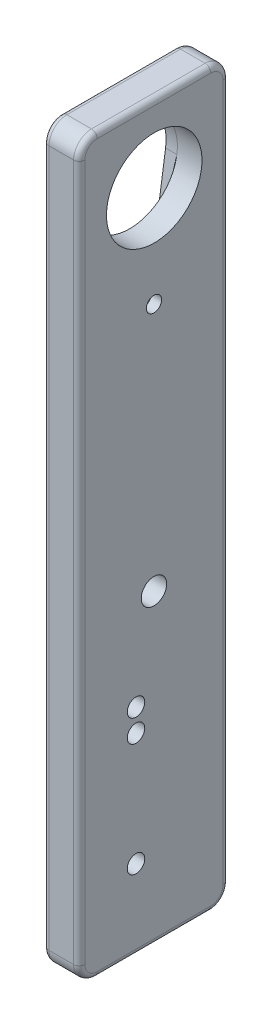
ISO-10303-21;
HEADER;
FILE_DESCRIPTION(('STEP AP214'),'2;1');
FILE_NAME('part.step','',(''),(''),'','','');
FILE_SCHEMA(('AUTOMOTIVE_DESIGN { 1 0 10303 214 1 1 1 1 }'));
ENDSEC;
DATA;
#1=APPLICATION_CONTEXT('core data for automotive mechanical design processes');
#2=APPLICATION_PROTOCOL_DEFINITION('international standard','automotive_design',2000,#1);
#3=PRODUCT_CONTEXT('',#1,'mechanical');
#4=PRODUCT('Part','Part','',(#3));
#5=PRODUCT_RELATED_PRODUCT_CATEGORY('part','',(#4));
#6=PRODUCT_DEFINITION_FORMATION('','',#4);
#7=PRODUCT_DEFINITION_CONTEXT('part definition',#1,'design');
#8=PRODUCT_DEFINITION('design','',#6,#7);
#9=PRODUCT_DEFINITION_SHAPE('','',#8);
#10=(LENGTH_UNIT() NAMED_UNIT(*) SI_UNIT(.MILLI.,.METRE.));
#11=(NAMED_UNIT(*) PLANE_ANGLE_UNIT() SI_UNIT($,.RADIAN.));
#12=(NAMED_UNIT(*) SI_UNIT($,.STERADIAN.) SOLID_ANGLE_UNIT());
#13=UNCERTAINTY_MEASURE_WITH_UNIT(LENGTH_MEASURE(1.E-05),#10,'distance_accuracy_value','');
#14=(GEOMETRIC_REPRESENTATION_CONTEXT(3) GLOBAL_UNCERTAINTY_ASSIGNED_CONTEXT((#13)) GLOBAL_UNIT_ASSIGNED_CONTEXT((#10,
#11,#12)) REPRESENTATION_CONTEXT('',''));
#15=CARTESIAN_POINT('',(0.,0.,0.));
#16=DIRECTION('',(0.,0.,1.));
#17=DIRECTION('',(1.,0.,0.));
#18=AXIS2_PLACEMENT_3D('',#15,#16,#17);
#19=CARTESIAN_POINT('',(-28.2777584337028,30.3156864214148,1.62195543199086));
#20=DIRECTION('',(-1.,0.,0.));
#21=DIRECTION('',(0.,0.,1.));
#22=AXIS2_PLACEMENT_3D('',#19,#20,#21);
#23=CYLINDRICAL_SURFACE('',#22,1.35);
#24=CARTESIAN_POINT('',(-39.6009605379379,30.3156864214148,1.62195543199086));
#25=DIRECTION('',(1.,0.,0.));
#26=DIRECTION('',(0.,0.,-1.));
#27=AXIS2_PLACEMENT_3D('',#24,#25,#26);
#28=CIRCLE('',#27,1.35);
#29=CARTESIAN_POINT('',(-39.6009605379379,30.3156864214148,0.271955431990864));
#30=VERTEX_POINT('',#29);
#31=EDGE_CURVE('E364',#30,#30,#28,.F.);
#32=ORIENTED_EDGE('',*,*,#31,.F.);
#33=EDGE_LOOP('',(#32));
#34=FACE_BOUND('',#33,.T.);
#35=CARTESIAN_POINT('',(-41.4109605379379,30.3156864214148,1.62195543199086));
#36=DIRECTION('',(-1.,0.,0.));
#37=DIRECTION('',(0.,0.,1.));
#38=AXIS2_PLACEMENT_3D('',#35,#36,#37);
#39=CIRCLE('',#38,1.35000000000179);
#40=CARTESIAN_POINT('',(-41.4109605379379,30.3156864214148,2.97195543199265));
#41=VERTEX_POINT('',#40);
#42=EDGE_CURVE('E637',#41,#41,#39,.T.);
#43=ORIENTED_EDGE('',*,*,#42,.T.);
#44=EDGE_LOOP('',(#43));
#45=FACE_BOUND('',#44,.T.);
#46=ADVANCED_FACE('F39',(#34,#45),#23,.F.);
#47=CARTESIAN_POINT('',(-39.6009605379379,-67.9224024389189,4.79852832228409));
#48=DIRECTION('',(0.,-1.,0.));
#49=DIRECTION('',(0.,0.,-1.));
#50=AXIS2_PLACEMENT_3D('',#47,#48,#49);
#51=PLANE('',#50);
#52=DIRECTION('',(-1.,0.,0.));
#53=VECTOR('',#52,1.);
#54=CARTESIAN_POINT('',(-39.6009605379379,-67.9224024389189,-8.42647167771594));
#55=LINE('',#54,#53);
#56=CARTESIAN_POINT('',(-44.9509605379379,-67.9224024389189,-8.42647167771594));
#57=VERTEX_POINT('',#56);
#58=CARTESIAN_POINT('',(-40.6009605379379,-67.9224024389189,-8.42647167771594));
#59=VERTEX_POINT('',#58);
#60=EDGE_CURVE('E268',#57,#59,#55,.F.);
#61=ORIENTED_EDGE('',*,*,#60,.T.);
#62=DIRECTION('',(0.,0.,1.));
#63=VECTOR('',#62,1.);
#64=CARTESIAN_POINT('',(-40.6009605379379,-67.9224024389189,4.79852832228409));
#65=LINE('',#64,#63);
#66=CARTESIAN_POINT('',(-40.6009605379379,-67.9224024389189,11.6735283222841));
#67=VERTEX_POINT('',#66);
#68=EDGE_CURVE('E314',#59,#67,#65,.T.);
#69=ORIENTED_EDGE('',*,*,#68,.T.);
#70=DIRECTION('',(-1.,0.,0.));
#71=VECTOR('',#70,1.);
#72=CARTESIAN_POINT('',(-39.6009605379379,-67.9224024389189,11.6735283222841));
#73=LINE('',#72,#71);
#74=CARTESIAN_POINT('',(-44.9509605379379,-67.9224024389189,11.6735283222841));
#75=VERTEX_POINT('',#74);
#76=EDGE_CURVE('E265',#67,#75,#73,.T.);
#77=ORIENTED_EDGE('',*,*,#76,.T.);
#78=DIRECTION('',(0.,0.,1.));
#79=VECTOR('',#78,1.);
#80=CARTESIAN_POINT('',(-44.9509605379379,-67.9224024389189,-8.42647167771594));
#81=LINE('',#80,#79);
#82=EDGE_CURVE('E312',#75,#57,#81,.F.);
#83=ORIENTED_EDGE('',*,*,#82,.T.);
#84=EDGE_LOOP('',(#61,#69,#77,#83));
#85=FACE_BOUND('',#84,.T.);
#86=ADVANCED_FACE('F399',(#85),#51,.T.);
#87=CARTESIAN_POINT('',(-39.6009605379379,28.6275975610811,-11.6014716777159));
#88=DIRECTION('',(0.,0.,-1.));
#89=DIRECTION('',(0.,1.,0.));
#90=AXIS2_PLACEMENT_3D('',#87,#88,#89);
#91=PLANE('',#90);
#92=DIRECTION('',(-1.,0.,0.));
#93=VECTOR('',#92,1.);
#94=CARTESIAN_POINT('',(-39.6009605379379,58.5025975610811,-11.6014716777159));
#95=LINE('',#94,#93);
#96=CARTESIAN_POINT('',(-44.9509605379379,58.5025975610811,-11.6014716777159));
#97=VERTEX_POINT('',#96);
#98=CARTESIAN_POINT('',(-40.6009605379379,58.5025975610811,-11.6014716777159));
#99=VERTEX_POINT('',#98);
#100=EDGE_CURVE('E262',#97,#99,#95,.F.);
#101=ORIENTED_EDGE('',*,*,#100,.T.);
#102=DIRECTION('',(0.,-1.,0.));
#103=VECTOR('',#102,1.);
#104=CARTESIAN_POINT('',(-40.6009605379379,28.6275975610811,-11.6014716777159));
#105=LINE('',#104,#103);
#106=CARTESIAN_POINT('',(-40.6009605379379,-64.7474024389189,-11.6014716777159));
#107=VERTEX_POINT('',#106);
#108=EDGE_CURVE('E11',#99,#107,#105,.T.);
#109=ORIENTED_EDGE('',*,*,#108,.T.);
#110=DIRECTION('',(-1.,0.,0.));
#111=VECTOR('',#110,1.);
#112=CARTESIAN_POINT('',(-39.6009605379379,-64.7474024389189,-11.6014716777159));
#113=LINE('',#112,#111);
#114=CARTESIAN_POINT('',(-44.9509605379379,-64.7474024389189,-11.6014716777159));
#115=VERTEX_POINT('',#114);
#116=EDGE_CURVE('E259',#107,#115,#113,.T.);
#117=ORIENTED_EDGE('',*,*,#116,.T.);
#118=DIRECTION('',(0.,-1.,0.));
#119=VECTOR('',#118,1.);
#120=CARTESIAN_POINT('',(-44.9509605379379,58.5025975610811,-11.6014716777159));
#121=LINE('',#120,#119);
#122=EDGE_CURVE('E48',#115,#97,#121,.F.);
#123=ORIENTED_EDGE('',*,*,#122,.T.);
#124=EDGE_LOOP('',(#101,#109,#117,#123));
#125=FACE_BOUND('',#124,.T.);
#126=ADVANCED_FACE('F459',(#125),#91,.T.);
#127=CARTESIAN_POINT('',(-39.6009605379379,61.6775975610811,4.79852832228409));
#128=DIRECTION('',(0.,1.,0.));
#129=DIRECTION('',(0.,0.,1.));
#130=AXIS2_PLACEMENT_3D('',#127,#128,#129);
#131=PLANE('',#130);
#132=DIRECTION('',(-1.,0.,0.));
#133=VECTOR('',#132,1.);
#134=CARTESIAN_POINT('',(-39.6009605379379,61.6775975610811,11.6735283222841));
#135=LINE('',#134,#133);
#136=CARTESIAN_POINT('',(-44.9509605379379,61.6775975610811,11.6735283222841));
#137=VERTEX_POINT('',#136);
#138=CARTESIAN_POINT('',(-40.6009605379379,61.6775975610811,11.6735283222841));
#139=VERTEX_POINT('',#138);
#140=EDGE_CURVE('E239',#137,#139,#135,.F.);
#141=ORIENTED_EDGE('',*,*,#140,.T.);
#142=DIRECTION('',(0.,0.,-1.));
#143=VECTOR('',#142,1.);
#144=CARTESIAN_POINT('',(-40.6009605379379,61.6775975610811,4.79852832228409));
#145=LINE('',#144,#143);
#146=CARTESIAN_POINT('',(-40.6009605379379,61.6775975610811,-8.42647167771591));
#147=VERTEX_POINT('',#146);
#148=EDGE_CURVE('E302',#139,#147,#145,.T.);
#149=ORIENTED_EDGE('',*,*,#148,.T.);
#150=DIRECTION('',(-1.,0.,0.));
#151=VECTOR('',#150,1.);
#152=CARTESIAN_POINT('',(-39.6009605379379,61.6775975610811,-8.42647167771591));
#153=LINE('',#152,#151);
#154=CARTESIAN_POINT('',(-44.9509605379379,61.6775975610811,-8.42647167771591));
#155=VERTEX_POINT('',#154);
#156=EDGE_CURVE('E256',#147,#155,#153,.T.);
#157=ORIENTED_EDGE('',*,*,#156,.T.);
#158=DIRECTION('',(0.,0.,-1.));
#159=VECTOR('',#158,1.);
#160=CARTESIAN_POINT('',(-44.9509605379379,61.6775975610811,11.6735283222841));
#161=LINE('',#160,#159);
#162=EDGE_CURVE('E300',#155,#137,#161,.F.);
#163=ORIENTED_EDGE('',*,*,#162,.T.);
#164=EDGE_LOOP('',(#141,#149,#157,#163));
#165=FACE_BOUND('',#164,.T.);
#166=ADVANCED_FACE('F445',(#165),#131,.T.);
#167=CARTESIAN_POINT('',(-39.6009605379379,28.6275975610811,14.8485283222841));
#168=DIRECTION('',(0.,0.,1.));
#169=DIRECTION('',(0.,-1.,0.));
#170=AXIS2_PLACEMENT_3D('',#167,#168,#169);
#171=PLANE('',#170);
#172=DIRECTION('',(-1.,0.,0.));
#173=VECTOR('',#172,1.);
#174=CARTESIAN_POINT('',(-39.6009605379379,58.5025975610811,14.8485283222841));
#175=LINE('',#174,#173);
#176=CARTESIAN_POINT('',(-40.6009605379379,58.5025975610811,14.8485283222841));
#177=VERTEX_POINT('',#176);
#178=CARTESIAN_POINT('',(-44.9509605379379,58.5025975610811,14.8485283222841));
#179=VERTEX_POINT('',#178);
#180=EDGE_CURVE('E274',#177,#179,#175,.T.);
#181=ORIENTED_EDGE('',*,*,#180,.T.);
#182=DIRECTION('',(0.,1.,0.));
#183=VECTOR('',#182,1.);
#184=CARTESIAN_POINT('',(-44.9509605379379,-64.7474024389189,14.8485283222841));
#185=LINE('',#184,#183);
#186=CARTESIAN_POINT('',(-44.9509605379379,-64.7474024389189,14.8485283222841));
#187=VERTEX_POINT('',#186);
#188=EDGE_CURVE('E336',#179,#187,#185,.F.);
#189=ORIENTED_EDGE('',*,*,#188,.T.);
#190=DIRECTION('',(-1.,0.,0.));
#191=VECTOR('',#190,1.);
#192=CARTESIAN_POINT('',(-39.6009605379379,-64.7474024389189,14.8485283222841));
#193=LINE('',#192,#191);
#194=CARTESIAN_POINT('',(-40.6009605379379,-64.7474024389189,14.8485283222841));
#195=VERTEX_POINT('',#194);
#196=EDGE_CURVE('E271',#187,#195,#193,.F.);
#197=ORIENTED_EDGE('',*,*,#196,.T.);
#198=DIRECTION('',(0.,1.,0.));
#199=VECTOR('',#198,1.);
#200=CARTESIAN_POINT('',(-40.6009605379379,28.6275975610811,14.8485283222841));
#201=LINE('',#200,#199);
#202=EDGE_CURVE('E334',#195,#177,#201,.T.);
#203=ORIENTED_EDGE('',*,*,#202,.T.);
#204=EDGE_LOOP('',(#181,#189,#197,#203));
#205=FACE_BOUND('',#204,.T.);
#206=ADVANCED_FACE('F424',(#205),#171,.T.);
#207=CARTESIAN_POINT('',(-39.6009605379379,28.6275975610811,4.79852832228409));
#208=DIRECTION('',(1.,0.,0.));
#209=DIRECTION('',(0.,0.,-1.));
#210=AXIS2_PLACEMENT_3D('',#207,#208,#209);
#211=PLANE('',#210);
#212=CARTESIAN_POINT('',(-39.6009605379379,58.5025975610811,-8.42647167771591));
#213=DIRECTION('',(1.,0.,0.));
#214=DIRECTION('',(0.,0.,-1.));
#215=AXIS2_PLACEMENT_3D('',#212,#213,#214);
#216=CIRCLE('',#215,2.175);
#217=CARTESIAN_POINT('',(-39.6009605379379,58.5025975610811,-10.6014716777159));
#218=VERTEX_POINT('',#217);
#219=CARTESIAN_POINT('',(-39.6009605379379,60.6775975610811,-8.42647167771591));
#220=VERTEX_POINT('',#219);
#221=EDGE_CURVE('E285',#218,#220,#216,.T.);
#222=ORIENTED_EDGE('',*,*,#221,.T.);
#223=DIRECTION('',(0.,0.,-1.));
#224=VECTOR('',#223,1.);
#225=CARTESIAN_POINT('',(-39.6009605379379,60.6775975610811,4.79852832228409));
#226=LINE('',#225,#224);
#227=CARTESIAN_POINT('',(-39.6009605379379,60.6775975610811,11.6735283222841));
#228=VERTEX_POINT('',#227);
#229=EDGE_CURVE('E292',#220,#228,#226,.F.);
#230=ORIENTED_EDGE('',*,*,#229,.T.);
#231=CARTESIAN_POINT('',(-39.6009605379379,58.5025975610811,11.6735283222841));
#232=DIRECTION('',(1.,0.,0.));
#233=DIRECTION('',(0.,0.,-1.));
#234=AXIS2_PLACEMENT_3D('',#231,#232,#233);
#235=CIRCLE('',#234,2.175);
#236=CARTESIAN_POINT('',(-39.6009605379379,58.5025975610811,13.8485283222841));
#237=VERTEX_POINT('',#236);
#238=EDGE_CURVE('E290',#228,#237,#235,.T.);
#239=ORIENTED_EDGE('',*,*,#238,.T.);
#240=DIRECTION('',(0.,1.,0.));
#241=VECTOR('',#240,1.);
#242=CARTESIAN_POINT('',(-39.6009605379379,28.6275975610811,13.8485283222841));
#243=LINE('',#242,#241);
#244=CARTESIAN_POINT('',(-39.6009605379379,-64.7474024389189,13.8485283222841));
#245=VERTEX_POINT('',#244);
#246=EDGE_CURVE('E288',#237,#245,#243,.F.);
#247=ORIENTED_EDGE('',*,*,#246,.T.);
#248=CARTESIAN_POINT('',(-39.6009605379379,-64.7474024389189,11.6735283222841));
#249=DIRECTION('',(1.,0.,0.));
#250=DIRECTION('',(0.,0.,-1.));
#251=AXIS2_PLACEMENT_3D('',#248,#249,#250);
#252=CIRCLE('',#251,2.175);
#253=CARTESIAN_POINT('',(-39.6009605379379,-66.9224024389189,11.6735283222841));
#254=VERTEX_POINT('',#253);
#255=EDGE_CURVE('E283',#245,#254,#252,.T.);
#256=ORIENTED_EDGE('',*,*,#255,.T.);
#257=DIRECTION('',(0.,0.,1.));
#258=VECTOR('',#257,1.);
#259=CARTESIAN_POINT('',(-39.6009605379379,-66.9224024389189,4.79852832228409));
#260=LINE('',#259,#258);
#261=CARTESIAN_POINT('',(-39.6009605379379,-66.9224024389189,-8.42647167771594));
#262=VERTEX_POINT('',#261);
#263=EDGE_CURVE('E281',#254,#262,#260,.F.);
#264=ORIENTED_EDGE('',*,*,#263,.T.);
#265=CARTESIAN_POINT('',(-39.6009605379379,-64.7474024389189,-8.42647167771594));
#266=DIRECTION('',(1.,0.,0.));
#267=DIRECTION('',(0.,0.,-1.));
#268=AXIS2_PLACEMENT_3D('',#265,#266,#267);
#269=CIRCLE('',#268,2.175);
#270=CARTESIAN_POINT('',(-39.6009605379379,-64.7474024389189,-10.6014716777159));
#271=VERTEX_POINT('',#270);
#272=EDGE_CURVE('E279',#262,#271,#269,.T.);
#273=ORIENTED_EDGE('',*,*,#272,.T.);
#274=DIRECTION('',(0.,-1.,0.));
#275=VECTOR('',#274,1.);
#276=CARTESIAN_POINT('',(-39.6009605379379,28.6275975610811,-10.6014716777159));
#277=LINE('',#276,#275);
#278=EDGE_CURVE('E277',#271,#218,#277,.F.);
#279=ORIENTED_EDGE('',*,*,#278,.T.);
#280=EDGE_LOOP('',(#222,#230,#239,#247,#256,#264,#273,#279));
#281=FACE_BOUND('',#280,.T.);
#282=CARTESIAN_POINT('',(-39.6009605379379,48.096086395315,1.57324528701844));
#283=DIRECTION('',(-1.,0.,0.));
#284=DIRECTION('',(0.,0.,1.));
#285=AXIS2_PLACEMENT_3D('',#282,#283,#284);
#286=CIRCLE('',#285,8.44960448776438);
#287=CARTESIAN_POINT('',(-39.6009605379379,48.096086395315,10.0228497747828));
#288=VERTEX_POINT('',#287);
#289=EDGE_CURVE('E220',#288,#288,#286,.T.);
#290=ORIENTED_EDGE('',*,*,#289,.T.);
#291=EDGE_LOOP('',(#290));
#292=FACE_BOUND('',#291,.T.);
#293=CARTESIAN_POINT('',(-39.6009605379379,-53.8224024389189,4.79852832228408));
#294=DIRECTION('',(1.,0.,0.));
#295=DIRECTION('',(0.,0.,-1.));
#296=AXIS2_PLACEMENT_3D('',#293,#294,#295);
#297=CIRCLE('',#296,1.55);
#298=CARTESIAN_POINT('',(-39.6009605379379,-53.8224024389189,3.24852832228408));
#299=VERTEX_POINT('',#298);
#300=EDGE_CURVE('E249',#299,#299,#297,.T.);
#301=ORIENTED_EDGE('',*,*,#300,.F.);
#302=EDGE_LOOP('',(#301));
#303=FACE_BOUND('',#302,.T.);
#304=CARTESIAN_POINT('',(-39.6009605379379,-33.8224024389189,4.79852832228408));
#305=DIRECTION('',(1.,0.,0.));
#306=DIRECTION('',(0.,0.,-1.));
#307=AXIS2_PLACEMENT_3D('',#304,#305,#306);
#308=CIRCLE('',#307,1.55);
#309=CARTESIAN_POINT('',(-39.6009605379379,-33.8224024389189,3.24852832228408));
#310=VERTEX_POINT('',#309);
#311=EDGE_CURVE('E243',#310,#310,#308,.T.);
#312=ORIENTED_EDGE('',*,*,#311,.F.);
#313=EDGE_LOOP('',(#312));
#314=FACE_BOUND('',#313,.T.);
#315=CARTESIAN_POINT('',(-39.6009605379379,-29.8224024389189,4.79852832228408));
#316=DIRECTION('',(1.,0.,0.));
#317=DIRECTION('',(0.,0.,-1.));
#318=AXIS2_PLACEMENT_3D('',#315,#316,#317);
#319=CIRCLE('',#318,1.55);
#320=CARTESIAN_POINT('',(-39.6009605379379,-29.8224024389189,3.24852832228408));
#321=VERTEX_POINT('',#320);
#322=EDGE_CURVE('E240',#321,#321,#319,.T.);
#323=ORIENTED_EDGE('',*,*,#322,.F.);
#324=EDGE_LOOP('',(#323));
#325=FACE_BOUND('',#324,.T.);
#326=CARTESIAN_POINT('',(-39.6009605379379,-13.6600363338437,1.62352832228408));
#327=DIRECTION('',(1.,0.,0.));
#328=DIRECTION('',(0.,0.,-1.));
#329=AXIS2_PLACEMENT_3D('',#326,#327,#328);
#330=CIRCLE('',#329,2.250000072);
#331=CARTESIAN_POINT('',(-39.6009605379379,-13.6600363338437,-0.626471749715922));
#332=VERTEX_POINT('',#331);
#333=EDGE_CURVE('E226',#332,#332,#330,.T.);
#334=ORIENTED_EDGE('',*,*,#333,.F.);
#335=EDGE_LOOP('',(#334));
#336=FACE_BOUND('',#335,.T.);
#337=ORIENTED_EDGE('',*,*,#31,.T.);
#338=EDGE_LOOP('',(#337));
#339=FACE_BOUND('',#338,.T.);
#340=ADVANCED_FACE('F414',(#281,#292,#303,#314,#325,#336,#339),#211,.T.);
#341=CARTESIAN_POINT('',(-45.9509605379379,28.6275975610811,4.79852832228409));
#342=DIRECTION('',(1.,0.,0.));
#343=DIRECTION('',(0.,0.,-1.));
#344=AXIS2_PLACEMENT_3D('',#341,#342,#343);
#345=PLANE('',#344);
#346=DIRECTION('',(0.,0.,-1.));
#347=VECTOR('',#346,1.);
#348=CARTESIAN_POINT('',(-45.9509605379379,60.6775975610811,-8.42647167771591));
#349=LINE('',#348,#347);
#350=CARTESIAN_POINT('',(-45.9509605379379,60.6775975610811,11.6735283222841));
#351=VERTEX_POINT('',#350);
#352=CARTESIAN_POINT('',(-45.9509605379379,60.6775975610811,-8.42647167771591));
#353=VERTEX_POINT('',#352);
#354=EDGE_CURVE('E56',#351,#353,#349,.T.);
#355=ORIENTED_EDGE('',*,*,#354,.T.);
#356=CARTESIAN_POINT('',(-45.9509605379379,58.5025975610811,-8.42647167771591));
#357=DIRECTION('',(1.,0.,0.));
#358=DIRECTION('',(0.,0.,-1.));
#359=AXIS2_PLACEMENT_3D('',#356,#357,#358);
#360=CIRCLE('',#359,2.175);
#361=CARTESIAN_POINT('',(-45.9509605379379,58.5025975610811,-10.6014716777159));
#362=VERTEX_POINT('',#361);
#363=EDGE_CURVE('E332',#353,#362,#360,.F.);
#364=ORIENTED_EDGE('',*,*,#363,.T.);
#365=DIRECTION('',(0.,-1.,0.));
#366=VECTOR('',#365,1.);
#367=CARTESIAN_POINT('',(-45.9509605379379,-64.7474024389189,-10.6014716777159));
#368=LINE('',#367,#366);
#369=CARTESIAN_POINT('',(-45.9509605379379,-64.7474024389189,-10.6014716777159));
#370=VERTEX_POINT('',#369);
#371=EDGE_CURVE('E320',#362,#370,#368,.T.);
#372=ORIENTED_EDGE('',*,*,#371,.T.);
#373=CARTESIAN_POINT('',(-45.9509605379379,-64.7474024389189,-8.42647167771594));
#374=DIRECTION('',(1.,0.,0.));
#375=DIRECTION('',(0.,0.,-1.));
#376=AXIS2_PLACEMENT_3D('',#373,#374,#375);
#377=CIRCLE('',#376,2.175);
#378=CARTESIAN_POINT('',(-45.9509605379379,-66.9224024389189,-8.42647167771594));
#379=VERTEX_POINT('',#378);
#380=EDGE_CURVE('E322',#370,#379,#377,.F.);
#381=ORIENTED_EDGE('',*,*,#380,.T.);
#382=DIRECTION('',(0.,0.,1.));
#383=VECTOR('',#382,1.);
#384=CARTESIAN_POINT('',(-45.9509605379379,-66.9224024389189,11.6735283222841));
#385=LINE('',#384,#383);
#386=CARTESIAN_POINT('',(-45.9509605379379,-66.9224024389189,11.6735283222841));
#387=VERTEX_POINT('',#386);
#388=EDGE_CURVE('E324',#379,#387,#385,.T.);
#389=ORIENTED_EDGE('',*,*,#388,.T.);
#390=CARTESIAN_POINT('',(-45.9509605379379,-64.7474024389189,11.6735283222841));
#391=DIRECTION('',(1.,0.,0.));
#392=DIRECTION('',(0.,0.,-1.));
#393=AXIS2_PLACEMENT_3D('',#390,#391,#392);
#394=CIRCLE('',#393,2.175);
#395=CARTESIAN_POINT('',(-45.9509605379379,-64.7474024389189,13.8485283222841));
#396=VERTEX_POINT('',#395);
#397=EDGE_CURVE('E326',#387,#396,#394,.F.);
#398=ORIENTED_EDGE('',*,*,#397,.T.);
#399=DIRECTION('',(0.,1.,0.));
#400=VECTOR('',#399,1.);
#401=CARTESIAN_POINT('',(-45.9509605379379,58.5025975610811,13.8485283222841));
#402=LINE('',#401,#400);
#403=CARTESIAN_POINT('',(-45.9509605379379,58.5025975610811,13.8485283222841));
#404=VERTEX_POINT('',#403);
#405=EDGE_CURVE('E328',#396,#404,#402,.T.);
#406=ORIENTED_EDGE('',*,*,#405,.T.);
#407=CARTESIAN_POINT('',(-45.9509605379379,58.5025975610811,11.6735283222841));
#408=DIRECTION('',(1.,0.,0.));
#409=DIRECTION('',(0.,0.,-1.));
#410=AXIS2_PLACEMENT_3D('',#407,#408,#409);
#411=CIRCLE('',#410,2.175);
#412=EDGE_CURVE('E61',#404,#351,#411,.F.);
#413=ORIENTED_EDGE('',*,*,#412,.T.);
#414=EDGE_LOOP('',(#355,#364,#372,#381,#389,#398,#406,#413));
#415=FACE_BOUND('',#414,.T.);
#416=DIRECTION('',(0.,0.,1.));
#417=VECTOR('',#416,1.);
#418=CARTESIAN_POINT('',(-45.9509605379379,25.7097350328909,-3.67147444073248));
#419=LINE('',#418,#417);
#420=CARTESIAN_POINT('',(-45.9509605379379,25.7097350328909,-3.67147444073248));
#421=VERTEX_POINT('',#420);
#422=CARTESIAN_POINT('',(-45.9509605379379,25.7097350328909,6.91853108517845));
#423=VERTEX_POINT('',#422);
#424=EDGE_CURVE('E219',#421,#423,#419,.T.);
#425=ORIENTED_EDGE('',*,*,#424,.F.);
#426=DIRECTION('',(0.,-0.989326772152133,0.145713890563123));
#427=VECTOR('',#426,1.);
#428=CARTESIAN_POINT('',(-45.9509605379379,46.8541532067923,-6.78574924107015));
#429=LINE('',#428,#427);
#430=CARTESIAN_POINT('',(-45.9509605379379,46.8541532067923,-6.78574924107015));
#431=VERTEX_POINT('',#430);
#432=EDGE_CURVE('E186',#431,#421,#429,.T.);
#433=ORIENTED_EDGE('',*,*,#432,.F.);
#434=CARTESIAN_POINT('',(-45.9509605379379,48.0927212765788,1.62352832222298));
#435=DIRECTION('',(-1.,0.,0.));
#436=DIRECTION('',(0.,0.,1.));
#437=AXIS2_PLACEMENT_3D('',#434,#435,#436);
#438=CIRCLE('',#437,8.5);
#439=CARTESIAN_POINT('',(-45.9509605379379,46.8541532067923,10.0328058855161));
#440=VERTEX_POINT('',#439);
#441=EDGE_CURVE('E207',#440,#431,#438,.T.);
#442=ORIENTED_EDGE('',*,*,#441,.F.);
#443=DIRECTION('',(0.,0.989326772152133,0.145713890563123));
#444=VECTOR('',#443,1.);
#445=CARTESIAN_POINT('',(-45.9509605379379,46.8541532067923,10.0328058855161));
#446=LINE('',#445,#444);
#447=EDGE_CURVE('E210',#423,#440,#446,.T.);
#448=ORIENTED_EDGE('',*,*,#447,.F.);
#449=EDGE_LOOP('',(#425,#433,#442,#448));
#450=FACE_BOUND('',#449,.T.);
#451=CARTESIAN_POINT('',(-45.9509605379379,-53.8224024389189,4.79852832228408));
#452=DIRECTION('',(1.,0.,0.));
#453=DIRECTION('',(0.,0.,-1.));
#454=AXIS2_PLACEMENT_3D('',#451,#452,#453);
#455=CIRCLE('',#454,1.55);
#456=CARTESIAN_POINT('',(-45.9509605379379,-53.8224024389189,3.24852832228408));
#457=VERTEX_POINT('',#456);
#458=EDGE_CURVE('E233',#457,#457,#455,.T.);
#459=ORIENTED_EDGE('',*,*,#458,.T.);
#460=EDGE_LOOP('',(#459));
#461=FACE_BOUND('',#460,.T.);
#462=CARTESIAN_POINT('',(-45.9509605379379,-33.8224024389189,4.79852832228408));
#463=DIRECTION('',(1.,0.,0.));
#464=DIRECTION('',(0.,0.,-1.));
#465=AXIS2_PLACEMENT_3D('',#462,#463,#464);
#466=CIRCLE('',#465,1.55);
#467=CARTESIAN_POINT('',(-45.9509605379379,-33.8224024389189,3.24852832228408));
#468=VERTEX_POINT('',#467);
#469=EDGE_CURVE('E246',#468,#468,#466,.T.);
#470=ORIENTED_EDGE('',*,*,#469,.T.);
#471=EDGE_LOOP('',(#470));
#472=FACE_BOUND('',#471,.T.);
#473=CARTESIAN_POINT('',(-45.9509605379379,-29.8224024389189,4.79852832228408));
#474=DIRECTION('',(1.,0.,0.));
#475=DIRECTION('',(0.,0.,-1.));
#476=AXIS2_PLACEMENT_3D('',#473,#474,#475);
#477=CIRCLE('',#476,1.55);
#478=CARTESIAN_POINT('',(-45.9509605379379,-29.8224024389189,3.24852832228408));
#479=VERTEX_POINT('',#478);
#480=EDGE_CURVE('E236',#479,#479,#477,.T.);
#481=ORIENTED_EDGE('',*,*,#480,.T.);
#482=EDGE_LOOP('',(#481));
#483=FACE_BOUND('',#482,.T.);
#484=CARTESIAN_POINT('',(-45.9509605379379,-13.6600363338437,1.62352832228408));
#485=DIRECTION('',(1.,0.,0.));
#486=DIRECTION('',(0.,0.,-1.));
#487=AXIS2_PLACEMENT_3D('',#484,#485,#486);
#488=CIRCLE('',#487,2.250000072);
#489=CARTESIAN_POINT('',(-45.9509605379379,-13.6600363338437,-0.626471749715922));
#490=VERTEX_POINT('',#489);
#491=EDGE_CURVE('E230',#490,#490,#488,.T.);
#492=ORIENTED_EDGE('',*,*,#491,.T.);
#493=EDGE_LOOP('',(#492));
#494=FACE_BOUND('',#493,.T.);
#495=ADVANCED_FACE('F539',(#415,#450,#461,#472,#483,#494),#345,.F.);
#496=CARTESIAN_POINT('',(-45.9509605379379,-53.8224024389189,4.79852832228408));
#497=DIRECTION('',(1.,0.,0.));
#498=DIRECTION('',(0.,0.,-1.));
#499=AXIS2_PLACEMENT_3D('',#496,#497,#498);
#500=CYLINDRICAL_SURFACE('',#499,1.55);
#501=ORIENTED_EDGE('',*,*,#458,.F.);
#502=EDGE_LOOP('',(#501));
#503=FACE_BOUND('',#502,.T.);
#504=ORIENTED_EDGE('',*,*,#300,.T.);
#505=EDGE_LOOP('',(#504));
#506=FACE_BOUND('',#505,.T.);
#507=ADVANCED_FACE('F535',(#503,#506),#500,.F.);
#508=CARTESIAN_POINT('',(-45.9509605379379,-33.8224024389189,4.79852832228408));
#509=DIRECTION('',(1.,0.,0.));
#510=DIRECTION('',(0.,0.,-1.));
#511=AXIS2_PLACEMENT_3D('',#508,#509,#510);
#512=CYLINDRICAL_SURFACE('',#511,1.55);
#513=ORIENTED_EDGE('',*,*,#469,.F.);
#514=EDGE_LOOP('',(#513));
#515=FACE_BOUND('',#514,.T.);
#516=ORIENTED_EDGE('',*,*,#311,.T.);
#517=EDGE_LOOP('',(#516));
#518=FACE_BOUND('',#517,.T.);
#519=ADVANCED_FACE('F531',(#515,#518),#512,.F.);
#520=CARTESIAN_POINT('',(-45.9509605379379,-29.8224024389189,4.79852832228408));
#521=DIRECTION('',(1.,0.,0.));
#522=DIRECTION('',(0.,0.,-1.));
#523=AXIS2_PLACEMENT_3D('',#520,#521,#522);
#524=CYLINDRICAL_SURFACE('',#523,1.55);
#525=ORIENTED_EDGE('',*,*,#480,.F.);
#526=EDGE_LOOP('',(#525));
#527=FACE_BOUND('',#526,.T.);
#528=ORIENTED_EDGE('',*,*,#322,.T.);
#529=EDGE_LOOP('',(#528));
#530=FACE_BOUND('',#529,.T.);
#531=ADVANCED_FACE('F528',(#527,#530),#524,.F.);
#532=CARTESIAN_POINT('',(-39.6009605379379,58.5025975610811,-8.42647167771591));
#533=DIRECTION('',(-1.,0.,0.));
#534=DIRECTION('',(0.,0.,1.));
#535=AXIS2_PLACEMENT_3D('',#532,#533,#534);
#536=CYLINDRICAL_SURFACE('',#535,3.175);
#537=ORIENTED_EDGE('',*,*,#156,.F.);
#538=CARTESIAN_POINT('',(-40.6009605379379,58.5025975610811,-8.42647167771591));
#539=DIRECTION('',(1.,0.,0.));
#540=DIRECTION('',(0.,0.,-1.));
#541=AXIS2_PLACEMENT_3D('',#538,#539,#540);
#542=CIRCLE('',#541,3.175);
#543=EDGE_CURVE('E297',#147,#99,#542,.F.);
#544=ORIENTED_EDGE('',*,*,#543,.T.);
#545=ORIENTED_EDGE('',*,*,#100,.F.);
#546=CARTESIAN_POINT('',(-44.9509605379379,58.5025975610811,-8.42647167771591));
#547=DIRECTION('',(1.,0.,0.));
#548=DIRECTION('',(0.,0.,-1.));
#549=AXIS2_PLACEMENT_3D('',#546,#547,#548);
#550=CIRCLE('',#549,3.175);
#551=EDGE_CURVE('E294',#97,#155,#550,.T.);
#552=ORIENTED_EDGE('',*,*,#551,.T.);
#553=EDGE_LOOP('',(#537,#544,#545,#552));
#554=FACE_BOUND('',#553,.T.);
#555=ADVANCED_FACE('F448',(#554),#536,.T.);
#556=CARTESIAN_POINT('',(-39.6009605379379,-64.7474024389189,-8.42647167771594));
#557=DIRECTION('',(-1.,0.,0.));
#558=DIRECTION('',(0.,0.,1.));
#559=AXIS2_PLACEMENT_3D('',#556,#557,#558);
#560=CYLINDRICAL_SURFACE('',#559,3.175);
#561=ORIENTED_EDGE('',*,*,#116,.F.);
#562=CARTESIAN_POINT('',(-40.6009605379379,-64.7474024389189,-8.42647167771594));
#563=DIRECTION('',(1.,0.,0.));
#564=DIRECTION('',(0.,0.,-1.));
#565=AXIS2_PLACEMENT_3D('',#562,#563,#564);
#566=CIRCLE('',#565,3.175);
#567=EDGE_CURVE('E318',#107,#59,#566,.F.);
#568=ORIENTED_EDGE('',*,*,#567,.T.);
#569=ORIENTED_EDGE('',*,*,#60,.F.);
#570=CARTESIAN_POINT('',(-44.9509605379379,-64.7474024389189,-8.42647167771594));
#571=DIRECTION('',(1.,0.,0.));
#572=DIRECTION('',(0.,0.,-1.));
#573=AXIS2_PLACEMENT_3D('',#570,#571,#572);
#574=CIRCLE('',#573,3.175);
#575=EDGE_CURVE('E316',#57,#115,#574,.T.);
#576=ORIENTED_EDGE('',*,*,#575,.T.);
#577=EDGE_LOOP('',(#561,#568,#569,#576));
#578=FACE_BOUND('',#577,.T.);
#579=ADVANCED_FACE('F462',(#578),#560,.T.);
#580=CARTESIAN_POINT('',(-39.6009605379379,-64.7474024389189,11.6735283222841));
#581=DIRECTION('',(-1.,0.,0.));
#582=DIRECTION('',(0.,0.,1.));
#583=AXIS2_PLACEMENT_3D('',#580,#581,#582);
#584=CYLINDRICAL_SURFACE('',#583,3.175);
#585=ORIENTED_EDGE('',*,*,#76,.F.);
#586=CARTESIAN_POINT('',(-40.6009605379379,-64.7474024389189,11.6735283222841));
#587=DIRECTION('',(1.,0.,0.));
#588=DIRECTION('',(0.,0.,-1.));
#589=AXIS2_PLACEMENT_3D('',#586,#587,#588);
#590=CIRCLE('',#589,3.175);
#591=EDGE_CURVE('E310',#67,#195,#590,.F.);
#592=ORIENTED_EDGE('',*,*,#591,.T.);
#593=ORIENTED_EDGE('',*,*,#196,.F.);
#594=CARTESIAN_POINT('',(-44.9509605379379,-64.7474024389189,11.6735283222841));
#595=DIRECTION('',(1.,0.,0.));
#596=DIRECTION('',(0.,0.,-1.));
#597=AXIS2_PLACEMENT_3D('',#594,#595,#596);
#598=CIRCLE('',#597,3.175);
#599=EDGE_CURVE('E308',#187,#75,#598,.T.);
#600=ORIENTED_EDGE('',*,*,#599,.T.);
#601=EDGE_LOOP('',(#585,#592,#593,#600));
#602=FACE_BOUND('',#601,.T.);
#603=ADVANCED_FACE('F396',(#602),#584,.T.);
#604=CARTESIAN_POINT('',(-39.6009605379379,58.5025975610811,11.6735283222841));
#605=DIRECTION('',(-1.,0.,0.));
#606=DIRECTION('',(0.,0.,1.));
#607=AXIS2_PLACEMENT_3D('',#604,#605,#606);
#608=CYLINDRICAL_SURFACE('',#607,3.175);
#609=ORIENTED_EDGE('',*,*,#180,.F.);
#610=CARTESIAN_POINT('',(-40.6009605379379,58.5025975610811,11.6735283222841));
#611=DIRECTION('',(1.,0.,0.));
#612=DIRECTION('',(0.,0.,-1.));
#613=AXIS2_PLACEMENT_3D('',#610,#611,#612);
#614=CIRCLE('',#613,3.175);
#615=EDGE_CURVE('E306',#177,#139,#614,.F.);
#616=ORIENTED_EDGE('',*,*,#615,.T.);
#617=ORIENTED_EDGE('',*,*,#140,.F.);
#618=CARTESIAN_POINT('',(-44.9509605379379,58.5025975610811,11.6735283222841));
#619=DIRECTION('',(1.,0.,0.));
#620=DIRECTION('',(0.,0.,-1.));
#621=AXIS2_PLACEMENT_3D('',#618,#619,#620);
#622=CIRCLE('',#621,3.175);
#623=EDGE_CURVE('E304',#137,#179,#622,.T.);
#624=ORIENTED_EDGE('',*,*,#623,.T.);
#625=EDGE_LOOP('',(#609,#616,#617,#624));
#626=FACE_BOUND('',#625,.T.);
#627=ADVANCED_FACE('F428',(#626),#608,.T.);
#628=CARTESIAN_POINT('',(-45.9509605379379,-13.6600363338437,1.62352832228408));
#629=DIRECTION('',(1.,0.,0.));
#630=DIRECTION('',(0.,0.,-1.));
#631=AXIS2_PLACEMENT_3D('',#628,#629,#630);
#632=CYLINDRICAL_SURFACE('',#631,2.250000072);
#633=ORIENTED_EDGE('',*,*,#491,.F.);
#634=EDGE_LOOP('',(#633));
#635=FACE_BOUND('',#634,.T.);
#636=ORIENTED_EDGE('',*,*,#333,.T.);
#637=EDGE_LOOP('',(#636));
#638=FACE_BOUND('',#637,.T.);
#639=ADVANCED_FACE('F524',(#635,#638),#632,.F.);
#640=CARTESIAN_POINT('',(-43.9509605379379,46.8541532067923,-6.78574924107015));
#641=DIRECTION('',(0.,-0.145713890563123,-0.989326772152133));
#642=DIRECTION('',(0.,0.989326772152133,-0.145713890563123));
#643=AXIS2_PLACEMENT_3D('',#640,#641,#642);
#644=PLANE('',#643);
#645=ORIENTED_EDGE('',*,*,#432,.T.);
#646=DIRECTION('',(-1.,0.,0.));
#647=VECTOR('',#646,1.);
#648=CARTESIAN_POINT('',(-43.9509605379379,25.7097350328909,-3.67147444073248));
#649=LINE('',#648,#647);
#650=CARTESIAN_POINT('',(-43.9509605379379,25.7097350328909,-3.67147444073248));
#651=VERTEX_POINT('',#650);
#652=EDGE_CURVE('E180',#651,#421,#649,.T.);
#653=ORIENTED_EDGE('',*,*,#652,.F.);
#654=DIRECTION('',(0.,-0.989326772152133,0.145713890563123));
#655=VECTOR('',#654,1.);
#656=CARTESIAN_POINT('',(-43.9509605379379,46.8541532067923,-6.78574924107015));
#657=LINE('',#656,#655);
#658=CARTESIAN_POINT('',(-43.9509605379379,46.8541532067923,-6.78574924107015));
#659=VERTEX_POINT('',#658);
#660=EDGE_CURVE('E184',#659,#651,#657,.T.);
#661=ORIENTED_EDGE('',*,*,#660,.F.);
#662=DIRECTION('',(-1.,0.,0.));
#663=VECTOR('',#662,1.);
#664=CARTESIAN_POINT('',(-43.9509605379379,46.8541532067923,-6.78574924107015));
#665=LINE('',#664,#663);
#666=EDGE_CURVE('E224',#659,#431,#665,.T.);
#667=ORIENTED_EDGE('',*,*,#666,.T.);
#668=EDGE_LOOP('',(#645,#653,#661,#667));
#669=FACE_BOUND('',#668,.T.);
#670=ADVANCED_FACE('F182',(#669),#644,.F.);
#671=CARTESIAN_POINT('',(-43.9509605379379,48.0927212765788,1.62352832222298));
#672=DIRECTION('',(-1.,0.,0.));
#673=DIRECTION('',(0.,0.,1.));
#674=AXIS2_PLACEMENT_3D('',#671,#672,#673);
#675=CYLINDRICAL_SURFACE('',#674,8.5);
#676=ORIENTED_EDGE('',*,*,#441,.T.);
#677=ORIENTED_EDGE('',*,*,#666,.F.);
#678=CARTESIAN_POINT('',(-43.9509605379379,48.0927212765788,1.62352832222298));
#679=DIRECTION('',(-1.,0.,0.));
#680=DIRECTION('',(0.,0.,1.));
#681=AXIS2_PLACEMENT_3D('',#678,#679,#680);
#682=CIRCLE('',#681,8.5);
#683=CARTESIAN_POINT('',(-43.9509605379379,48.6603017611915,-6.85750064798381));
#684=VERTEX_POINT('',#683);
#685=EDGE_CURVE('E205',#684,#659,#682,.T.);
#686=ORIENTED_EDGE('',*,*,#685,.F.);
#687=CARTESIAN_POINT('',(-43.9509605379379,46.8541532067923,10.0328058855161));
#688=VERTEX_POINT('',#687);
#689=EDGE_CURVE('E191',#688,#684,#682,.T.);
#690=ORIENTED_EDGE('',*,*,#689,.F.);
#691=DIRECTION('',(-1.,0.,0.));
#692=VECTOR('',#691,1.);
#693=CARTESIAN_POINT('',(-43.9509605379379,46.8541532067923,10.0328058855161));
#694=LINE('',#693,#692);
#695=EDGE_CURVE('E227',#688,#440,#694,.T.);
#696=ORIENTED_EDGE('',*,*,#695,.T.);
#697=EDGE_LOOP('',(#676,#677,#686,#690,#696));
#698=FACE_BOUND('',#697,.T.);
#699=ADVANCED_FACE('F512',(#698),#675,.F.);
#700=CARTESIAN_POINT('',(-43.9509605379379,46.8541532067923,10.0328058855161));
#701=DIRECTION('',(0.,-0.145713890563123,0.989326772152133));
#702=DIRECTION('',(0.,-0.989326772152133,-0.145713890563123));
#703=AXIS2_PLACEMENT_3D('',#700,#701,#702);
#704=PLANE('',#703);
#705=ORIENTED_EDGE('',*,*,#447,.T.);
#706=ORIENTED_EDGE('',*,*,#695,.F.);
#707=DIRECTION('',(0.,0.989326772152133,0.145713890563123));
#708=VECTOR('',#707,1.);
#709=CARTESIAN_POINT('',(-43.9509605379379,46.8541532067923,10.0328058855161));
#710=LINE('',#709,#708);
#711=CARTESIAN_POINT('',(-43.9509605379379,25.7097350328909,6.91853108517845));
#712=VERTEX_POINT('',#711);
#713=EDGE_CURVE('E199',#712,#688,#710,.T.);
#714=ORIENTED_EDGE('',*,*,#713,.F.);
#715=DIRECTION('',(-1.,0.,0.));
#716=VECTOR('',#715,1.);
#717=CARTESIAN_POINT('',(-43.9509605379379,25.7097350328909,6.91853108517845));
#718=LINE('',#717,#716);
#719=EDGE_CURVE('E190',#712,#423,#718,.T.);
#720=ORIENTED_EDGE('',*,*,#719,.T.);
#721=EDGE_LOOP('',(#705,#706,#714,#720));
#722=FACE_BOUND('',#721,.T.);
#723=ADVANCED_FACE('F515',(#722),#704,.F.);
#724=CARTESIAN_POINT('',(-43.9509605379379,25.7097350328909,-3.67147444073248));
#725=DIRECTION('',(0.,-1.,0.));
#726=DIRECTION('',(0.,0.,-1.));
#727=AXIS2_PLACEMENT_3D('',#724,#725,#726);
#728=PLANE('',#727);
#729=ORIENTED_EDGE('',*,*,#424,.T.);
#730=ORIENTED_EDGE('',*,*,#719,.F.);
#731=DIRECTION('',(0.,0.,1.));
#732=VECTOR('',#731,1.);
#733=CARTESIAN_POINT('',(-43.9509605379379,25.7097350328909,-3.67147444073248));
#734=LINE('',#733,#732);
#735=EDGE_CURVE('E194',#651,#712,#734,.T.);
#736=ORIENTED_EDGE('',*,*,#735,.F.);
#737=ORIENTED_EDGE('',*,*,#652,.T.);
#738=EDGE_LOOP('',(#729,#730,#736,#737));
#739=FACE_BOUND('',#738,.T.);
#740=ADVANCED_FACE('F195',(#739),#728,.F.);
#741=CARTESIAN_POINT('',(-43.9509605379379,48.0927212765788,1.62352832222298));
#742=DIRECTION('',(-1.,0.,0.));
#743=DIRECTION('',(0.,0.,1.));
#744=AXIS2_PLACEMENT_3D('',#741,#742,#743);
#745=PLANE('',#744);
#746=CARTESIAN_POINT('',(-43.9509605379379,30.3156864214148,1.62195543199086));
#747=DIRECTION('',(-1.,0.,0.));
#748=DIRECTION('',(0.,0.,1.));
#749=AXIS2_PLACEMENT_3D('',#746,#747,#748);
#750=CIRCLE('',#749,3.9);
#751=CARTESIAN_POINT('',(-43.9509605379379,30.3156864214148,5.52195543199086));
#752=VERTEX_POINT('',#751);
#753=EDGE_CURVE('E641',#752,#752,#750,.T.);
#754=ORIENTED_EDGE('',*,*,#753,.F.);
#755=EDGE_LOOP('',(#754));
#756=FACE_BOUND('',#755,.T.);
#757=ORIENTED_EDGE('',*,*,#689,.T.);
#758=CARTESIAN_POINT('',(-43.9509605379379,48.096086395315,1.57324528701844));
#759=DIRECTION('',(-1.,0.,0.));
#760=DIRECTION('',(0.,0.,1.));
#761=AXIS2_PLACEMENT_3D('',#758,#759,#760);
#762=CIRCLE('',#761,8.44960448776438);
#763=EDGE_CURVE('E213',#684,#684,#762,.T.);
#764=ORIENTED_EDGE('',*,*,#763,.F.);
#765=ORIENTED_EDGE('',*,*,#685,.T.);
#766=ORIENTED_EDGE('',*,*,#660,.T.);
#767=ORIENTED_EDGE('',*,*,#735,.T.);
#768=ORIENTED_EDGE('',*,*,#713,.T.);
#769=EDGE_LOOP('',(#757,#764,#765,#766,#767,#768));
#770=FACE_BOUND('',#769,.T.);
#771=ADVANCED_FACE('F202',(#756,#770),#745,.T.);
#772=CARTESIAN_POINT('',(-39.6009605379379,48.096086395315,1.57324528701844));
#773=DIRECTION('',(-1.,0.,0.));
#774=DIRECTION('',(0.,0.,1.));
#775=AXIS2_PLACEMENT_3D('',#772,#773,#774);
#776=CYLINDRICAL_SURFACE('',#775,8.44960448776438);
#777=ORIENTED_EDGE('',*,*,#289,.F.);
#778=EDGE_LOOP('',(#777));
#779=FACE_BOUND('',#778,.T.);
#780=ORIENTED_EDGE('',*,*,#763,.T.);
#781=EDGE_LOOP('',(#780));
#782=FACE_BOUND('',#781,.T.);
#783=ADVANCED_FACE('F505',(#779,#782),#776,.F.);
#784=CARTESIAN_POINT('',(-40.6009605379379,-64.7474024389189,11.6735283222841));
#785=DIRECTION('',(1.,0.,0.));
#786=DIRECTION('',(0.,0.,-1.));
#787=AXIS2_PLACEMENT_3D('',#784,#785,#786);
#788=TOROIDAL_SURFACE('',#787,2.175,1.);
#789=CARTESIAN_POINT('',(-40.6009605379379,-64.7474024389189,13.8485283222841));
#790=DIRECTION('',(0.,1.,0.));
#791=DIRECTION('',(0.,0.,1.));
#792=AXIS2_PLACEMENT_3D('',#789,#790,#791);
#793=CIRCLE('',#792,1.);
#794=EDGE_CURVE('E355',#195,#245,#793,.T.);
#795=ORIENTED_EDGE('',*,*,#794,.F.);
#796=ORIENTED_EDGE('',*,*,#591,.F.);
#797=CARTESIAN_POINT('',(-40.6009605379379,-66.9224024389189,11.6735283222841));
#798=DIRECTION('',(0.,0.,-1.));
#799=DIRECTION('',(-1.,0.,0.));
#800=AXIS2_PLACEMENT_3D('',#797,#798,#799);
#801=CIRCLE('',#800,1.);
#802=EDGE_CURVE('E358',#254,#67,#801,.T.);
#803=ORIENTED_EDGE('',*,*,#802,.F.);
#804=ORIENTED_EDGE('',*,*,#255,.F.);
#805=EDGE_LOOP('',(#795,#796,#803,#804));
#806=FACE_BOUND('',#805,.T.);
#807=ADVANCED_FACE('F421',(#806),#788,.T.);
#808=CARTESIAN_POINT('',(-40.6009605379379,-66.9224024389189,4.79852832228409));
#809=DIRECTION('',(0.,0.,1.));
#810=DIRECTION('',(1.,0.,0.));
#811=AXIS2_PLACEMENT_3D('',#808,#809,#810);
#812=CYLINDRICAL_SURFACE('',#811,1.);
#813=ORIENTED_EDGE('',*,*,#802,.T.);
#814=ORIENTED_EDGE('',*,*,#68,.F.);
#815=CARTESIAN_POINT('',(-40.6009605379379,-66.9224024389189,-8.42647167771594));
#816=DIRECTION('',(0.,0.,-1.));
#817=DIRECTION('',(-1.,0.,0.));
#818=AXIS2_PLACEMENT_3D('',#815,#816,#817);
#819=CIRCLE('',#818,1.);
#820=EDGE_CURVE('E352',#262,#59,#819,.T.);
#821=ORIENTED_EDGE('',*,*,#820,.F.);
#822=ORIENTED_EDGE('',*,*,#263,.F.);
#823=EDGE_LOOP('',(#813,#814,#821,#822));
#824=FACE_BOUND('',#823,.T.);
#825=ADVANCED_FACE('F404',(#824),#812,.T.);
#826=CARTESIAN_POINT('',(-40.6009605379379,28.6275975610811,13.8485283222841));
#827=DIRECTION('',(0.,1.,0.));
#828=DIRECTION('',(0.,0.,1.));
#829=AXIS2_PLACEMENT_3D('',#826,#827,#828);
#830=CYLINDRICAL_SURFACE('',#829,1.);
#831=ORIENTED_EDGE('',*,*,#794,.T.);
#832=ORIENTED_EDGE('',*,*,#246,.F.);
#833=CARTESIAN_POINT('',(-40.6009605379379,58.5025975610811,13.8485283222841));
#834=DIRECTION('',(0.,1.,0.));
#835=DIRECTION('',(0.,0.,1.));
#836=AXIS2_PLACEMENT_3D('',#833,#834,#835);
#837=CIRCLE('',#836,1.);
#838=EDGE_CURVE('E349',#177,#237,#837,.T.);
#839=ORIENTED_EDGE('',*,*,#838,.F.);
#840=ORIENTED_EDGE('',*,*,#202,.F.);
#841=EDGE_LOOP('',(#831,#832,#839,#840));
#842=FACE_BOUND('',#841,.T.);
#843=ADVANCED_FACE('F433',(#842),#830,.T.);
#844=CARTESIAN_POINT('',(-40.6009605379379,-64.7474024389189,-8.42647167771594));
#845=DIRECTION('',(1.,0.,0.));
#846=DIRECTION('',(0.,0.,-1.));
#847=AXIS2_PLACEMENT_3D('',#844,#845,#846);
#848=TOROIDAL_SURFACE('',#847,2.175,1.);
#849=ORIENTED_EDGE('',*,*,#820,.T.);
#850=ORIENTED_EDGE('',*,*,#567,.F.);
#851=CARTESIAN_POINT('',(-40.6009605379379,-64.7474024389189,-10.6014716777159));
#852=DIRECTION('',(0.,1.,0.));
#853=DIRECTION('',(0.,0.,1.));
#854=AXIS2_PLACEMENT_3D('',#851,#852,#853);
#855=CIRCLE('',#854,1.);
#856=EDGE_CURVE('E346',#271,#107,#855,.T.);
#857=ORIENTED_EDGE('',*,*,#856,.F.);
#858=ORIENTED_EDGE('',*,*,#272,.F.);
#859=EDGE_LOOP('',(#849,#850,#857,#858));
#860=FACE_BOUND('',#859,.T.);
#861=ADVANCED_FACE('F410',(#860),#848,.T.);
#862=CARTESIAN_POINT('',(-40.6009605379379,58.5025975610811,11.6735283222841));
#863=DIRECTION('',(1.,0.,0.));
#864=DIRECTION('',(0.,0.,-1.));
#865=AXIS2_PLACEMENT_3D('',#862,#863,#864);
#866=TOROIDAL_SURFACE('',#865,2.175,1.);
#867=ORIENTED_EDGE('',*,*,#838,.T.);
#868=ORIENTED_EDGE('',*,*,#238,.F.);
#869=CARTESIAN_POINT('',(-40.6009605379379,60.6775975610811,11.6735283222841));
#870=DIRECTION('',(0.,0.,-1.));
#871=DIRECTION('',(-1.,0.,0.));
#872=AXIS2_PLACEMENT_3D('',#869,#870,#871);
#873=CIRCLE('',#872,1.);
#874=EDGE_CURVE('E343',#139,#228,#873,.T.);
#875=ORIENTED_EDGE('',*,*,#874,.F.);
#876=ORIENTED_EDGE('',*,*,#615,.F.);
#877=EDGE_LOOP('',(#867,#868,#875,#876));
#878=FACE_BOUND('',#877,.T.);
#879=ADVANCED_FACE('F437',(#878),#866,.T.);
#880=CARTESIAN_POINT('',(-40.6009605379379,28.6275975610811,-10.6014716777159));
#881=DIRECTION('',(0.,-1.,0.));
#882=DIRECTION('',(0.,0.,-1.));
#883=AXIS2_PLACEMENT_3D('',#880,#881,#882);
#884=CYLINDRICAL_SURFACE('',#883,1.);
#885=ORIENTED_EDGE('',*,*,#856,.T.);
#886=ORIENTED_EDGE('',*,*,#108,.F.);
#887=CARTESIAN_POINT('',(-40.6009605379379,58.5025975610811,-10.6014716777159));
#888=DIRECTION('',(0.,1.,0.));
#889=DIRECTION('',(0.,0.,1.));
#890=AXIS2_PLACEMENT_3D('',#887,#888,#889);
#891=CIRCLE('',#890,1.);
#892=EDGE_CURVE('E341',#218,#99,#891,.T.);
#893=ORIENTED_EDGE('',*,*,#892,.F.);
#894=ORIENTED_EDGE('',*,*,#278,.F.);
#895=EDGE_LOOP('',(#885,#886,#893,#894));
#896=FACE_BOUND('',#895,.T.);
#897=ADVANCED_FACE('F456',(#896),#884,.T.);
#898=CARTESIAN_POINT('',(-40.6009605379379,60.6775975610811,4.79852832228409));
#899=DIRECTION('',(0.,0.,-1.));
#900=DIRECTION('',(-1.,0.,0.));
#901=AXIS2_PLACEMENT_3D('',#898,#899,#900);
#902=CYLINDRICAL_SURFACE('',#901,1.);
#903=ORIENTED_EDGE('',*,*,#874,.T.);
#904=ORIENTED_EDGE('',*,*,#229,.F.);
#905=CARTESIAN_POINT('',(-40.6009605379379,60.6775975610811,-8.42647167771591));
#906=DIRECTION('',(0.,0.,-1.));
#907=DIRECTION('',(-1.,0.,0.));
#908=AXIS2_PLACEMENT_3D('',#905,#906,#907);
#909=CIRCLE('',#908,1.);
#910=EDGE_CURVE('E339',#147,#220,#909,.T.);
#911=ORIENTED_EDGE('',*,*,#910,.F.);
#912=ORIENTED_EDGE('',*,*,#148,.F.);
#913=EDGE_LOOP('',(#903,#904,#911,#912));
#914=FACE_BOUND('',#913,.T.);
#915=ADVANCED_FACE('F442',(#914),#902,.T.);
#916=CARTESIAN_POINT('',(-40.6009605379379,58.5025975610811,-8.42647167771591));
#917=DIRECTION('',(1.,0.,0.));
#918=DIRECTION('',(0.,0.,-1.));
#919=AXIS2_PLACEMENT_3D('',#916,#917,#918);
#920=TOROIDAL_SURFACE('',#919,2.175,1.);
#921=ORIENTED_EDGE('',*,*,#892,.T.);
#922=ORIENTED_EDGE('',*,*,#543,.F.);
#923=ORIENTED_EDGE('',*,*,#910,.T.);
#924=ORIENTED_EDGE('',*,*,#221,.F.);
#925=EDGE_LOOP('',(#921,#922,#923,#924));
#926=FACE_BOUND('',#925,.T.);
#927=ADVANCED_FACE('F452',(#926),#920,.T.);
#928=CARTESIAN_POINT('',(-44.9509605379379,-64.7474024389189,11.6735283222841));
#929=DIRECTION('',(1.,0.,0.));
#930=DIRECTION('',(0.,0.,-1.));
#931=AXIS2_PLACEMENT_3D('',#928,#929,#930);
#932=TOROIDAL_SURFACE('',#931,2.175,1.);
#933=CARTESIAN_POINT('',(-44.9509605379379,-66.9224024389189,11.6735283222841));
#934=DIRECTION('',(0.,0.,-1.));
#935=DIRECTION('',(-1.,0.,0.));
#936=AXIS2_PLACEMENT_3D('',#933,#934,#935);
#937=CIRCLE('',#936,1.);
#938=EDGE_CURVE('E377',#75,#387,#937,.T.);
#939=ORIENTED_EDGE('',*,*,#938,.F.);
#940=ORIENTED_EDGE('',*,*,#599,.F.);
#941=CARTESIAN_POINT('',(-44.9509605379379,-64.7474024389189,13.8485283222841));
#942=DIRECTION('',(0.,1.,0.));
#943=DIRECTION('',(0.,0.,1.));
#944=AXIS2_PLACEMENT_3D('',#941,#942,#943);
#945=CIRCLE('',#944,1.);
#946=EDGE_CURVE('E43',#396,#187,#945,.T.);
#947=ORIENTED_EDGE('',*,*,#946,.F.);
#948=ORIENTED_EDGE('',*,*,#397,.F.);
#949=EDGE_LOOP('',(#939,#940,#947,#948));
#950=FACE_BOUND('',#949,.T.);
#951=ADVANCED_FACE('F41',(#950),#932,.T.);
#952=CARTESIAN_POINT('',(-44.9509605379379,28.6275975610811,13.8485283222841));
#953=DIRECTION('',(0.,-1.,0.));
#954=DIRECTION('',(0.,0.,-1.));
#955=AXIS2_PLACEMENT_3D('',#952,#953,#954);
#956=CYLINDRICAL_SURFACE('',#955,1.);
#957=ORIENTED_EDGE('',*,*,#946,.T.);
#958=ORIENTED_EDGE('',*,*,#188,.F.);
#959=CARTESIAN_POINT('',(-44.9509605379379,58.5025975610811,13.8485283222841));
#960=DIRECTION('',(0.,1.,0.));
#961=DIRECTION('',(0.,0.,1.));
#962=AXIS2_PLACEMENT_3D('',#959,#960,#961);
#963=CIRCLE('',#962,1.);
#964=EDGE_CURVE('E375',#404,#179,#963,.T.);
#965=ORIENTED_EDGE('',*,*,#964,.F.);
#966=ORIENTED_EDGE('',*,*,#405,.F.);
#967=EDGE_LOOP('',(#957,#958,#965,#966));
#968=FACE_BOUND('',#967,.T.);
#969=ADVANCED_FACE('F388',(#968),#956,.T.);
#970=CARTESIAN_POINT('',(-44.9509605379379,-66.9224024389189,4.79852832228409));
#971=DIRECTION('',(0.,0.,-1.));
#972=DIRECTION('',(-1.,0.,0.));
#973=AXIS2_PLACEMENT_3D('',#970,#971,#972);
#974=CYLINDRICAL_SURFACE('',#973,1.);
#975=ORIENTED_EDGE('',*,*,#938,.T.);
#976=ORIENTED_EDGE('',*,*,#388,.F.);
#977=CARTESIAN_POINT('',(-44.9509605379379,-66.9224024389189,-8.42647167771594));
#978=DIRECTION('',(0.,0.,-1.));
#979=DIRECTION('',(-1.,0.,0.));
#980=AXIS2_PLACEMENT_3D('',#977,#978,#979);
#981=CIRCLE('',#980,1.);
#982=EDGE_CURVE('E372',#57,#379,#981,.T.);
#983=ORIENTED_EDGE('',*,*,#982,.F.);
#984=ORIENTED_EDGE('',*,*,#82,.F.);
#985=EDGE_LOOP('',(#975,#976,#983,#984));
#986=FACE_BOUND('',#985,.T.);
#987=ADVANCED_FACE('F482',(#986),#974,.T.);
#988=CARTESIAN_POINT('',(-44.9509605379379,58.5025975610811,11.6735283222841));
#989=DIRECTION('',(1.,0.,0.));
#990=DIRECTION('',(0.,0.,-1.));
#991=AXIS2_PLACEMENT_3D('',#988,#989,#990);
#992=TOROIDAL_SURFACE('',#991,2.175,1.);
#993=ORIENTED_EDGE('',*,*,#964,.T.);
#994=ORIENTED_EDGE('',*,*,#623,.F.);
#995=CARTESIAN_POINT('',(-44.9509605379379,60.6775975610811,11.6735283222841));
#996=DIRECTION('',(0.,0.,-1.));
#997=DIRECTION('',(-1.,0.,0.));
#998=AXIS2_PLACEMENT_3D('',#995,#996,#997);
#999=CIRCLE('',#998,1.);
#1000=EDGE_CURVE('E369',#351,#137,#999,.T.);
#1001=ORIENTED_EDGE('',*,*,#1000,.F.);
#1002=ORIENTED_EDGE('',*,*,#412,.F.);
#1003=EDGE_LOOP('',(#993,#994,#1001,#1002));
#1004=FACE_BOUND('',#1003,.T.);
#1005=ADVANCED_FACE('F480',(#1004),#992,.T.);
#1006=CARTESIAN_POINT('',(-44.9509605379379,-64.7474024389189,-8.42647167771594));
#1007=DIRECTION('',(1.,0.,0.));
#1008=DIRECTION('',(0.,0.,-1.));
#1009=AXIS2_PLACEMENT_3D('',#1006,#1007,#1008);
#1010=TOROIDAL_SURFACE('',#1009,2.175,1.);
#1011=ORIENTED_EDGE('',*,*,#982,.T.);
#1012=ORIENTED_EDGE('',*,*,#380,.F.);
#1013=CARTESIAN_POINT('',(-44.9509605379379,-64.7474024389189,-10.6014716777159));
#1014=DIRECTION('',(0.,1.,0.));
#1015=DIRECTION('',(0.,0.,1.));
#1016=AXIS2_PLACEMENT_3D('',#1013,#1014,#1015);
#1017=CIRCLE('',#1016,1.);
#1018=EDGE_CURVE('E366',#115,#370,#1017,.T.);
#1019=ORIENTED_EDGE('',*,*,#1018,.F.);
#1020=ORIENTED_EDGE('',*,*,#575,.F.);
#1021=EDGE_LOOP('',(#1011,#1012,#1019,#1020));
#1022=FACE_BOUND('',#1021,.T.);
#1023=ADVANCED_FACE('F466',(#1022),#1010,.T.);
#1024=CARTESIAN_POINT('',(-44.9509605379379,60.6775975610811,4.79852832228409));
#1025=DIRECTION('',(0.,0.,1.));
#1026=DIRECTION('',(1.,0.,0.));
#1027=AXIS2_PLACEMENT_3D('',#1024,#1025,#1026);
#1028=CYLINDRICAL_SURFACE('',#1027,1.);
#1029=ORIENTED_EDGE('',*,*,#1000,.T.);
#1030=ORIENTED_EDGE('',*,*,#162,.F.);
#1031=CARTESIAN_POINT('',(-44.9509605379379,60.6775975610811,-8.42647167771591));
#1032=DIRECTION('',(0.,0.,-1.));
#1033=DIRECTION('',(-1.,0.,0.));
#1034=AXIS2_PLACEMENT_3D('',#1031,#1032,#1033);
#1035=CIRCLE('',#1034,1.);
#1036=EDGE_CURVE('E363',#353,#155,#1035,.T.);
#1037=ORIENTED_EDGE('',*,*,#1036,.F.);
#1038=ORIENTED_EDGE('',*,*,#354,.F.);
#1039=EDGE_LOOP('',(#1029,#1030,#1037,#1038));
#1040=FACE_BOUND('',#1039,.T.);
#1041=ADVANCED_FACE('F478',(#1040),#1028,.T.);
#1042=CARTESIAN_POINT('',(-44.9509605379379,28.6275975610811,-10.6014716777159));
#1043=DIRECTION('',(0.,1.,0.));
#1044=DIRECTION('',(0.,0.,1.));
#1045=AXIS2_PLACEMENT_3D('',#1042,#1043,#1044);
#1046=CYLINDRICAL_SURFACE('',#1045,1.);
#1047=ORIENTED_EDGE('',*,*,#1018,.T.);
#1048=ORIENTED_EDGE('',*,*,#371,.F.);
#1049=CARTESIAN_POINT('',(-44.9509605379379,58.5025975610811,-10.6014716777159));
#1050=DIRECTION('',(0.,1.,0.));
#1051=DIRECTION('',(0.,0.,1.));
#1052=AXIS2_PLACEMENT_3D('',#1049,#1050,#1051);
#1053=CIRCLE('',#1052,1.);
#1054=EDGE_CURVE('E361',#97,#362,#1053,.T.);
#1055=ORIENTED_EDGE('',*,*,#1054,.F.);
#1056=ORIENTED_EDGE('',*,*,#122,.F.);
#1057=EDGE_LOOP('',(#1047,#1048,#1055,#1056));
#1058=FACE_BOUND('',#1057,.T.);
#1059=ADVANCED_FACE('F472',(#1058),#1046,.T.);
#1060=CARTESIAN_POINT('',(-44.9509605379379,58.5025975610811,-8.42647167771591));
#1061=DIRECTION('',(1.,0.,0.));
#1062=DIRECTION('',(0.,0.,-1.));
#1063=AXIS2_PLACEMENT_3D('',#1060,#1061,#1062);
#1064=TOROIDAL_SURFACE('',#1063,2.175,1.);
#1065=ORIENTED_EDGE('',*,*,#1036,.T.);
#1066=ORIENTED_EDGE('',*,*,#551,.F.);
#1067=ORIENTED_EDGE('',*,*,#1054,.T.);
#1068=ORIENTED_EDGE('',*,*,#363,.F.);
#1069=EDGE_LOOP('',(#1065,#1066,#1067,#1068));
#1070=FACE_BOUND('',#1069,.T.);
#1071=ADVANCED_FACE('F474',(#1070),#1064,.T.);
#1072=CARTESIAN_POINT('',(-41.4109605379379,30.3156864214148,1.62195543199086));
#1073=DIRECTION('',(-1.,0.,0.));
#1074=DIRECTION('',(0.,0.,1.));
#1075=AXIS2_PLACEMENT_3D('',#1072,#1073,#1074);
#1076=CYLINDRICAL_SURFACE('',#1075,3.9);
#1077=CARTESIAN_POINT('',(-41.4109605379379,30.3156864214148,1.62195543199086));
#1078=DIRECTION('',(-1.,0.,0.));
#1079=DIRECTION('',(0.,0.,1.));
#1080=AXIS2_PLACEMENT_3D('',#1077,#1078,#1079);
#1081=CIRCLE('',#1080,3.9);
#1082=CARTESIAN_POINT('',(-41.4109605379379,30.3156864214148,5.52195543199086));
#1083=VERTEX_POINT('',#1082);
#1084=EDGE_CURVE('E640',#1083,#1083,#1081,.T.);
#1085=ORIENTED_EDGE('',*,*,#1084,.F.);
#1086=EDGE_LOOP('',(#1085));
#1087=FACE_BOUND('',#1086,.T.);
#1088=ORIENTED_EDGE('',*,*,#753,.T.);
#1089=EDGE_LOOP('',(#1088));
#1090=FACE_BOUND('',#1089,.T.);
#1091=ADVANCED_FACE('F503',(#1087,#1090),#1076,.F.);
#1092=CARTESIAN_POINT('',(-41.4109605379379,30.3156864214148,1.62195543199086));
#1093=DIRECTION('',(-1.,0.,0.));
#1094=DIRECTION('',(0.,0.,1.));
#1095=AXIS2_PLACEMENT_3D('',#1092,#1093,#1094);
#1096=PLANE('',#1095);
#1097=ORIENTED_EDGE('',*,*,#42,.F.);
#1098=EDGE_LOOP('',(#1097));
#1099=FACE_BOUND('',#1098,.T.);
#1100=ORIENTED_EDGE('',*,*,#1084,.T.);
#1101=EDGE_LOOP('',(#1100));
#1102=FACE_BOUND('',#1101,.T.);
#1103=ADVANCED_FACE('F619',(#1099,#1102),#1096,.T.);
#1104=CLOSED_SHELL('',(#46,#86,#126,#166,#206,#340,#495,#507,#519,#531,#555,#579,#603,#627,#639,
#670,#699,#723,#740,#771,#783,#807,#825,#843,#861,#879,#897,#915,#927,#951,#969,#987,#1005,
#1023,#1041,#1059,#1071,#1091,#1103));
#1105=MANIFOLD_SOLID_BREP('B2',#1104);
#1106=ADVANCED_BREP_SHAPE_REPRESENTATION('',(#18,#1105),#14);
#1107=SHAPE_DEFINITION_REPRESENTATION(#9,#1106);
ENDSEC;
END-ISO-10303-21;
